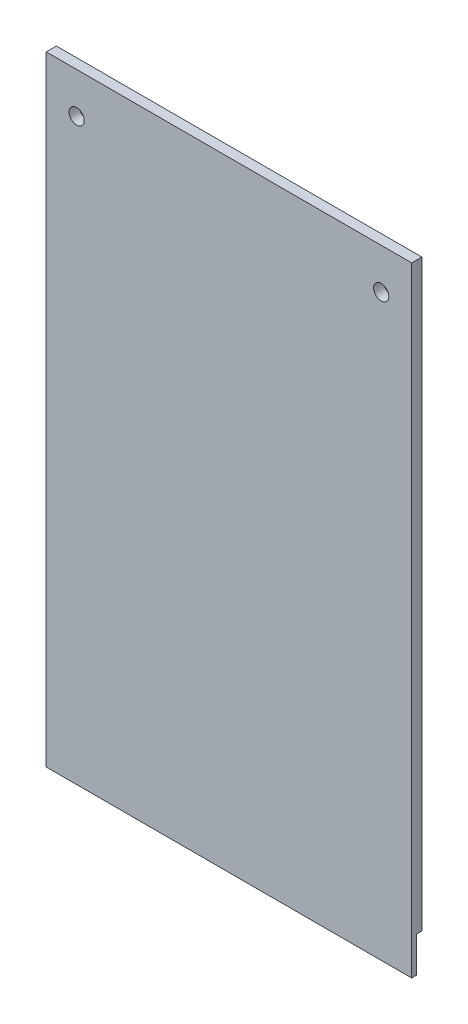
from build123d import *

# Parameters (mm, degrees)
SKETCH2_W           = 72
SKETCH2_H           = 244
BOSS_EXTRUDE1_DEPTH = 2
SKETCH3_R           = 1.5
CUT_EXTRUDE1_DEPTH  = 128.21635115
SKETCH4_W           = 72
SKETCH4_H           = 122
CUT_EXTRUDE2_DEPTH  = 128.21635115
SKETCH5_W           = 1
SKETCH5_H           = 7
CUT_EXTRUDE3_DEPTH  = 142.675685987


with BuildPart() as part:
    # Sketch2 → Boss-Extrude1 (new body)
    with BuildSketch(Plane.XY):
        Rectangle(SKETCH2_W, SKETCH2_H)
    extrude(amount=BOSS_EXTRUDE1_DEPTH)

    # Sketch3 → Cut-Extrude1 (cut, through all)
    with BuildSketch(Plane.XY.offset(2)):
        with Locations((30, 114)):
            Circle(SKETCH3_R)
        with Locations((-30, 114)):
            Circle(SKETCH3_R)
        with Locations((30, -114)):
            Circle(SKETCH3_R)
        with Locations((-30, -114)):
            Circle(SKETCH3_R)
    extrude(amount=-CUT_EXTRUDE1_DEPTH, mode=Mode.SUBTRACT)

    # Sketch4 → Cut-Extrude2 (cut, through all)
    with BuildSketch(Plane.XY.offset(2)):
        with Locations((0, -61)):
            Rectangle(SKETCH4_W, SKETCH4_H)
    extrude(amount=-CUT_EXTRUDE2_DEPTH, mode=Mode.SUBTRACT)

    # Sketch5 → Cut-Extrude3 (cut, through all)
    with BuildSketch(Plane(origin=(36, 0, 0), x_dir=(0, 0, -1), z_dir=(1, 0, 0))):
        with Locations((-0.5, 3.5)):
            Rectangle(SKETCH5_W, SKETCH5_H)
    extrude(amount=-CUT_EXTRUDE3_DEPTH, mode=Mode.SUBTRACT)


solid = part.part
